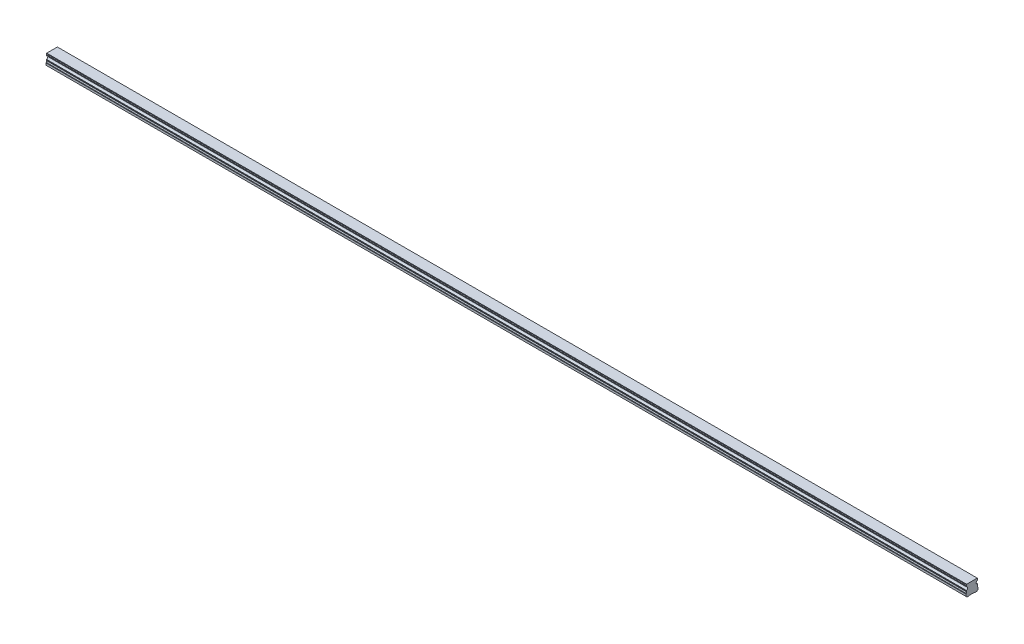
from build123d import *

# Parameters (mm, degrees)
BOSS_EXTRUDE1_DEPTH        = 1140
SKETCH3_R                  = 2.5
SKETCH3_R_2                = 2.1
CUT_EXTRUDE3_DEPTH         = 7
SKETCH3_2_R                = 2.1
CUT_EXTRUDE4_DEPTH         = 9.5
CHAMFER1_SIZE              = 0.4
LPATTERN2_COUNT            = 19
LPATTERN2_PITCH            = 60
CHAMFER1_OF_LPATTERN2_SIZE = 0.4


with BuildPart() as part:
    # Sketch1 → Boss-Extrude1 (new body)
    with BuildSketch(Plane(origin=(0, 0, 0), x_dir=(0, 0, -1), z_dir=(1, 0, 0))):
        with BuildLine():
            Line((6.59, 14), (-6.59, 14))
            Line((-6.59, 14), (-6.59, 13.15))
            Line((-6.59, 13.15), (-6.96, 12.356532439))
            Line((-6.96, 12.356532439), (-6.96, 11.435174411))
            ThreePointArc((-6.96, 11.435174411), (-5.25, 9.5), (-6.96, 7.564825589))
            Line((-6.96, 7.564825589), (-6.96, 6.643467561))
            Line((-6.96, 6.643467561), (-6.59, 5.85))
            Line((-6.59, 5.85), (-7.032116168, 4.2))
            Line((-7.032116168, 4.2), (-7.5, 3.929867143))
            Line((-7.5, 3.929867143), (-7.5, 1.4))
            Line((-7.5, 1.4), (-6.1, 0))
            Line((-6.1, 0), (-3.65, 0))
            Line((-3.65, 0), (-3.25, 0.4))
            Line((-3.25, 0.4), (3.25, 0.4))
            Line((3.25, 0.4), (3.65, 0))
            Line((3.65, 0), (6.1, 0))
            Line((6.1, 0), (7.5, 1.4))
            Line((7.5, 1.4), (7.5, 3.929867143))
            Line((7.5, 3.929867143), (7.032116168, 4.2))
            Line((7.032116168, 4.2), (6.59, 5.85))
            Line((6.59, 5.85), (6.96, 6.643467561))
            Line((6.96, 6.643467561), (6.96, 7.564825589))
            ThreePointArc((6.96, 7.564825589), (5.25, 9.5), (6.96, 11.435174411))
            Line((6.96, 11.435174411), (6.96, 12.356532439))
            Line((6.96, 12.356532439), (6.59, 13.15))
            Line((6.59, 13.15), (6.59, 14))
        make_face()
    extrude(amount=BOSS_EXTRUDE1_DEPTH)

    # Sketch3 → Cut-Extrude3 (cut)
    with BuildSketch(Plane.XZ):
        with Locations(Location((30, 0, 0), (0, 0, 270))):
            Circle(SKETCH3_R)
        with Locations(Location((30, 0, 0), (0, 0, 270))):
            Circle(SKETCH3_R_2, mode=Mode.SUBTRACT)
    cut_extrude3 = extrude(amount=-CUT_EXTRUDE3_DEPTH, mode=Mode.SUBTRACT)

    # Sketch3_2 → Cut-Extrude4 (cut)
    with BuildSketch(Plane.XZ):
        with Locations(Location((30, 0, 0), (0, 0, 270))):
            Circle(SKETCH3_2_R)
    cut_extrude4 = extrude(amount=-CUT_EXTRUDE4_DEPTH, mode=Mode.SUBTRACT)

    # Cut-Extrude5 cone 1 section (on through the dimple's axis) → Cut-Extrude5 (revolve, cut)
    with BuildSketch(Plane(origin=(30, 9.5, 0), x_dir=(0, 0, -1), z_dir=(1, 0, 0))):
        Polygon((0, 0), (2.1, 0), (0, 1.212435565), align=None)
    revolve(axis=Axis((30, 9.5, 0), (0, 1, 0)), mode=Mode.SUBTRACT)

    # Chamfer1
    chamfer1_edges = [part.edges().sort_by_distance(p)[0] for p in [
        (30, 0.4, 2.5),
    ]]
    chamfer(chamfer1_edges, length=CHAMFER1_SIZE)

    # LPattern2: Cut-Extrude3, Cut-Extrude4 ×19
    with Locations(*[(i * LPATTERN2_PITCH, 0, 0) for i in range(1, LPATTERN2_COUNT)]):
        add(cut_extrude3, mode=Mode.SUBTRACT)
        add(cut_extrude4, mode=Mode.SUBTRACT)

    # Chamfer1 of LPattern2
    chamfer1_of_lpattern2_edges = [part.edges().sort_by_distance(p)[0] for p in [
        (90, 0.4, 2.5),
        (150, 0.4, 2.5),
        (210, 0.4, 2.5),
        (270, 0.4, 2.5),
        (330, 0.4, 2.5),
        (390, 0.4, 2.5),
        (450, 0.4, 2.5),
        (510, 0.4, 2.5),
        (570, 0.4, 2.5),
        (630, 0.4, 2.5),
        (690, 0.4, 2.5),
        (750, 0.4, 2.5),
        (810, 0.4, 2.5),
        (870, 0.4, 2.5),
        (930, 0.4, 2.5),
        (990, 0.4, 2.5),
        (1050, 0.4, 2.5),
        (1110, 0.4, 2.5),
    ]]
    chamfer(chamfer1_of_lpattern2_edges, length=CHAMFER1_OF_LPATTERN2_SIZE)


solid = part.part
